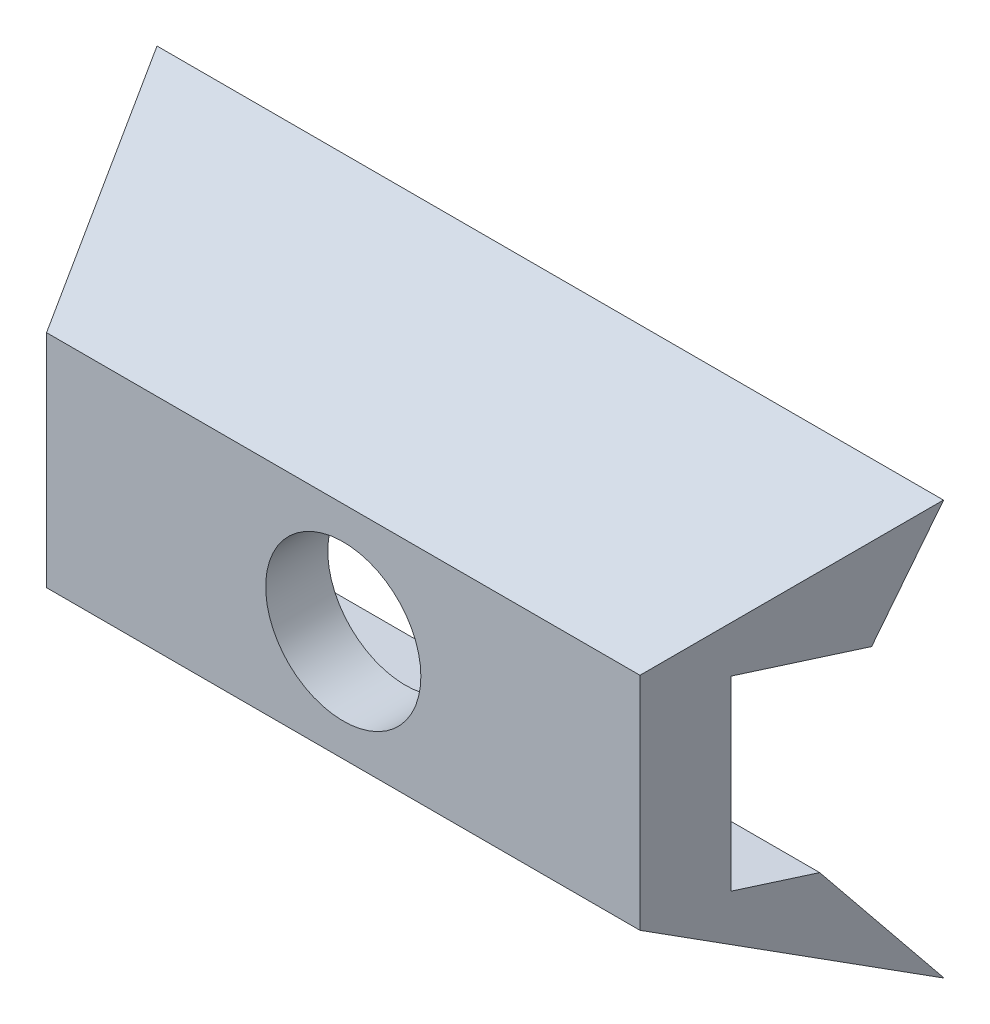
from build123d import *

# Parameters (mm, degrees)
SKETCH_1_W               = 76
SKETCH_1_H               = 40
EXTRUDE_1_DEPTH          = 20
EXTRUDE_1_TAPER          = 25
CUT_EXTRUDE_1_DEPTH      = 48.370877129
CUT_EXTRUDE_1_DEPTH_BACK = 48.370877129
SKETCH_3_R               = 7.5
CUT_EXTRUDE_2_DEPTH      = 48.370877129


with BuildPart() as part:
    # Sketch 1 → Extrude 1 (new body)
    with BuildSketch(Plane.XY):
        Rectangle(SKETCH_1_W, SKETCH_1_H)
    extrude(amount=EXTRUDE_1_DEPTH, taper=EXTRUDE_1_TAPER)

    # Sketch 2 → Cut-Extrude 1 (cut, two sides: drawn at the far end of the back side and taken through both)
    with BuildSketch(Plane(origin=(0, 0, 0), x_dir=(0, 0, -1), z_dir=(1, 0, 0)).offset(-CUT_EXTRUDE_1_DEPTH_BACK)):
        Polygon((-14, 9), (-14, -9), (-8.158061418, -9), (19.213661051, -45.758754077), (19.213661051, 64.529443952), (-4.732666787, 9), align=None)
    extrude(amount=CUT_EXTRUDE_1_DEPTH + CUT_EXTRUDE_1_DEPTH_BACK, mode=Mode.SUBTRACT)

    # Sketch 3 → Cut-Extrude 2 (cut, through all)
    with BuildSketch(Plane.XY.offset(20)):
        Circle(SKETCH_3_R)
    extrude(amount=-CUT_EXTRUDE_2_DEPTH, mode=Mode.SUBTRACT)


solid = part.part
